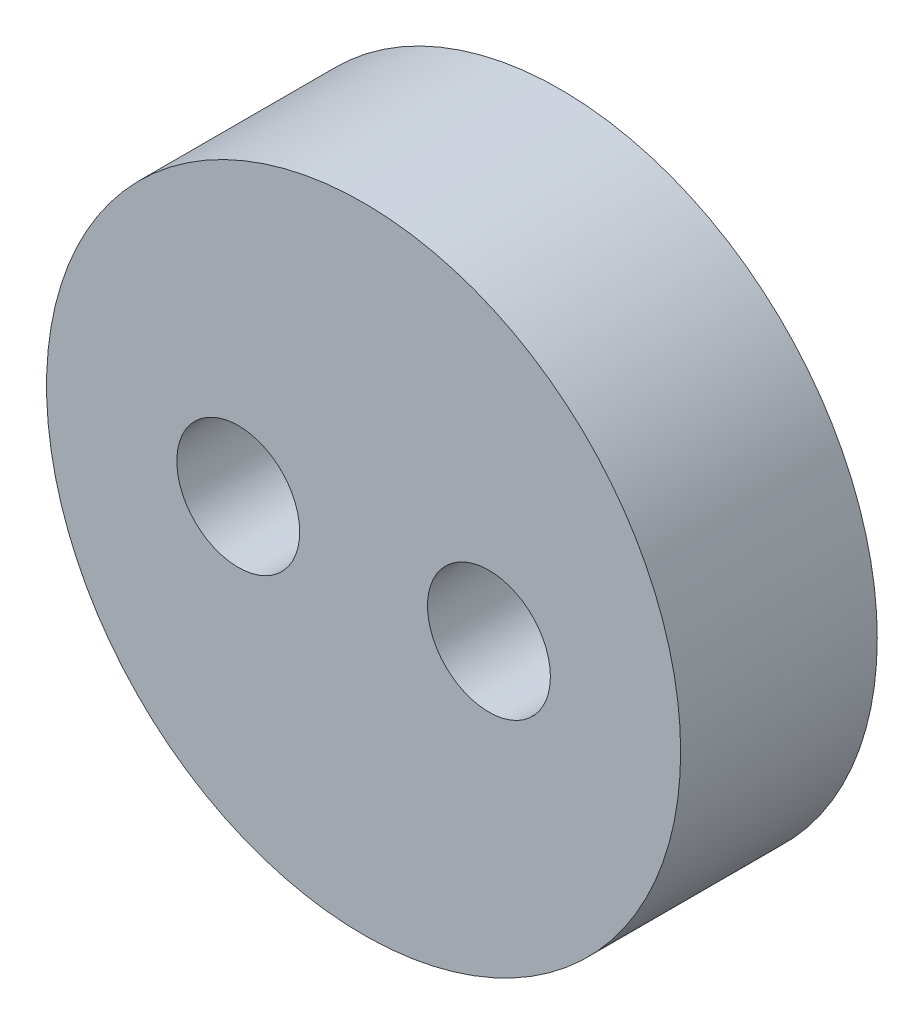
ISO-10303-21;
HEADER;
FILE_DESCRIPTION(('STEP AP214'),'2;1');
FILE_NAME('part.step','',(''),(''),'','','');
FILE_SCHEMA(('AUTOMOTIVE_DESIGN { 1 0 10303 214 1 1 1 1 }'));
ENDSEC;
DATA;
#1=APPLICATION_CONTEXT('core data for automotive mechanical design processes');
#2=APPLICATION_PROTOCOL_DEFINITION('international standard','automotive_design',2000,#1);
#3=PRODUCT_CONTEXT('',#1,'mechanical');
#4=PRODUCT('Part','Part','',(#3));
#5=PRODUCT_RELATED_PRODUCT_CATEGORY('part','',(#4));
#6=PRODUCT_DEFINITION_FORMATION('','',#4);
#7=PRODUCT_DEFINITION_CONTEXT('part definition',#1,'design');
#8=PRODUCT_DEFINITION('design','',#6,#7);
#9=PRODUCT_DEFINITION_SHAPE('','',#8);
#10=(LENGTH_UNIT() NAMED_UNIT(*) SI_UNIT(.MILLI.,.METRE.));
#11=(NAMED_UNIT(*) PLANE_ANGLE_UNIT() SI_UNIT($,.RADIAN.));
#12=(NAMED_UNIT(*) SI_UNIT($,.STERADIAN.) SOLID_ANGLE_UNIT());
#13=UNCERTAINTY_MEASURE_WITH_UNIT(LENGTH_MEASURE(1.E-05),#10,'distance_accuracy_value','');
#14=(GEOMETRIC_REPRESENTATION_CONTEXT(3) GLOBAL_UNCERTAINTY_ASSIGNED_CONTEXT((#13)) GLOBAL_UNIT_ASSIGNED_CONTEXT((#10,
#11,#12)) REPRESENTATION_CONTEXT('',''));
#15=CARTESIAN_POINT('',(0.,0.,0.));
#16=DIRECTION('',(0.,0.,1.));
#17=DIRECTION('',(1.,0.,0.));
#18=AXIS2_PLACEMENT_3D('',#15,#16,#17);
#19=CARTESIAN_POINT('',(-3.09418181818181,0.,0.));
#20=DIRECTION('',(0.,0.,1.));
#21=DIRECTION('',(1.,0.,0.));
#22=AXIS2_PLACEMENT_3D('',#19,#20,#21);
#23=PLANE('',#22);
#24=CARTESIAN_POINT('',(-3.23849999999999,0.,0.));
#25=DIRECTION('',(0.,0.,1.));
#26=DIRECTION('',(1.,0.,0.));
#27=AXIS2_PLACEMENT_3D('',#24,#25,#26);
#28=CIRCLE('',#27,1.5875);
#29=CARTESIAN_POINT('',(-1.65099999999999,0.,0.));
#30=VERTEX_POINT('',#29);
#31=EDGE_CURVE('E18',#30,#30,#28,.T.);
#32=ORIENTED_EDGE('',*,*,#31,.T.);
#33=EDGE_LOOP('',(#32));
#34=FACE_BOUND('',#33,.T.);
#35=ADVANCED_FACE('F14',(#34),#23,.T.);
#36=CARTESIAN_POINT('',(3.3828181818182,0.,0.));
#37=DIRECTION('',(0.,0.,1.));
#38=DIRECTION('',(1.,0.,0.));
#39=AXIS2_PLACEMENT_3D('',#36,#37,#38);
#40=PLANE('',#39);
#41=CARTESIAN_POINT('',(3.2385,0.,0.));
#42=DIRECTION('',(0.,0.,1.));
#43=DIRECTION('',(1.,0.,0.));
#44=AXIS2_PLACEMENT_3D('',#41,#42,#43);
#45=CIRCLE('',#44,1.5875);
#46=CARTESIAN_POINT('',(4.826,0.,0.));
#47=VERTEX_POINT('',#46);
#48=EDGE_CURVE('E34',#47,#47,#45,.T.);
#49=ORIENTED_EDGE('',*,*,#48,.T.);
#50=EDGE_LOOP('',(#49));
#51=FACE_BOUND('',#50,.T.);
#52=ADVANCED_FACE('F45',(#51),#40,.T.);
#53=CARTESIAN_POINT('',(-3.23849999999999,0.,0.));
#54=DIRECTION('',(0.,0.,1.));
#55=DIRECTION('',(1.,0.,0.));
#56=AXIS2_PLACEMENT_3D('',#53,#54,#55);
#57=CYLINDRICAL_SURFACE('',#56,1.5875);
#58=CARTESIAN_POINT('',(-3.23849999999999,0.,2.53999999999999));
#59=DIRECTION('',(0.,0.,1.));
#60=DIRECTION('',(1.,0.,0.));
#61=AXIS2_PLACEMENT_3D('',#58,#59,#60);
#62=CIRCLE('',#61,1.5875);
#63=CARTESIAN_POINT('',(-1.65099999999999,0.,2.53999999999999));
#64=VERTEX_POINT('',#63);
#65=EDGE_CURVE('E32',#64,#64,#62,.F.);
#66=ORIENTED_EDGE('',*,*,#65,.F.);
#67=EDGE_LOOP('',(#66));
#68=FACE_BOUND('',#67,.T.);
#69=ORIENTED_EDGE('',*,*,#31,.F.);
#70=EDGE_LOOP('',(#69));
#71=FACE_BOUND('',#70,.T.);
#72=ADVANCED_FACE('F42',(#68,#71),#57,.F.);
#73=CARTESIAN_POINT('',(3.2385,0.,0.));
#74=DIRECTION('',(0.,0.,1.));
#75=DIRECTION('',(1.,0.,0.));
#76=AXIS2_PLACEMENT_3D('',#73,#74,#75);
#77=CYLINDRICAL_SURFACE('',#76,1.5875);
#78=CARTESIAN_POINT('',(3.2385,0.,2.53999999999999));
#79=DIRECTION('',(0.,0.,1.));
#80=DIRECTION('',(1.,0.,0.));
#81=AXIS2_PLACEMENT_3D('',#78,#79,#80);
#82=CIRCLE('',#81,1.5875);
#83=CARTESIAN_POINT('',(4.826,0.,2.53999999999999));
#84=VERTEX_POINT('',#83);
#85=EDGE_CURVE('E27',#84,#84,#82,.F.);
#86=ORIENTED_EDGE('',*,*,#85,.F.);
#87=EDGE_LOOP('',(#86));
#88=FACE_BOUND('',#87,.T.);
#89=ORIENTED_EDGE('',*,*,#48,.F.);
#90=EDGE_LOOP('',(#89));
#91=FACE_BOUND('',#90,.T.);
#92=ADVANCED_FACE('F44',(#88,#91),#77,.F.);
#93=CARTESIAN_POINT('',(0.744681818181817,0.,-2.54));
#94=DIRECTION('',(0.,0.,1.));
#95=DIRECTION('',(1.,0.,0.));
#96=AXIS2_PLACEMENT_3D('',#93,#94,#95);
#97=PLANE('',#96);
#98=CARTESIAN_POINT('',(0.,0.,-2.54));
#99=DIRECTION('',(0.,0.,1.));
#100=DIRECTION('',(1.,0.,0.));
#101=AXIS2_PLACEMENT_3D('',#98,#99,#100);
#102=CIRCLE('',#101,8.1915);
#103=CARTESIAN_POINT('',(8.1915,0.,-2.54));
#104=VERTEX_POINT('',#103);
#105=EDGE_CURVE('E22',#104,#104,#102,.T.);
#106=ORIENTED_EDGE('',*,*,#105,.F.);
#107=EDGE_LOOP('',(#106));
#108=FACE_BOUND('',#107,.T.);
#109=ADVANCED_FACE('F53',(#108),#97,.F.);
#110=CARTESIAN_POINT('',(0.744681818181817,0.,2.53999999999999));
#111=DIRECTION('',(0.,0.,1.));
#112=DIRECTION('',(1.,0.,0.));
#113=AXIS2_PLACEMENT_3D('',#110,#111,#112);
#114=PLANE('',#113);
#115=ORIENTED_EDGE('',*,*,#85,.T.);
#116=EDGE_LOOP('',(#115));
#117=FACE_BOUND('',#116,.T.);
#118=ORIENTED_EDGE('',*,*,#65,.T.);
#119=EDGE_LOOP('',(#118));
#120=FACE_BOUND('',#119,.T.);
#121=CARTESIAN_POINT('',(0.,0.,2.53999999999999));
#122=DIRECTION('',(0.,0.,1.));
#123=DIRECTION('',(1.,0.,0.));
#124=AXIS2_PLACEMENT_3D('',#121,#122,#123);
#125=CIRCLE('',#124,8.1915);
#126=CARTESIAN_POINT('',(8.1915,0.,2.53999999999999));
#127=VERTEX_POINT('',#126);
#128=EDGE_CURVE('E10',#127,#127,#125,.F.);
#129=ORIENTED_EDGE('',*,*,#128,.F.);
#130=EDGE_LOOP('',(#129));
#131=FACE_BOUND('',#130,.T.);
#132=ADVANCED_FACE('F59',(#117,#120,#131),#114,.T.);
#133=CARTESIAN_POINT('',(0.,0.,-2.54));
#134=DIRECTION('',(0.,0.,1.));
#135=DIRECTION('',(1.,0.,0.));
#136=AXIS2_PLACEMENT_3D('',#133,#134,#135);
#137=CYLINDRICAL_SURFACE('',#136,8.1915);
#138=ORIENTED_EDGE('',*,*,#105,.T.);
#139=EDGE_LOOP('',(#138));
#140=FACE_BOUND('',#139,.T.);
#141=ORIENTED_EDGE('',*,*,#128,.T.);
#142=EDGE_LOOP('',(#141));
#143=FACE_BOUND('',#142,.T.);
#144=ADVANCED_FACE('F16',(#140,#143),#137,.T.);
#145=CLOSED_SHELL('',(#35,#52,#72,#92,#109,#132,#144));
#146=MANIFOLD_SOLID_BREP('B1',#145);
#147=ADVANCED_BREP_SHAPE_REPRESENTATION('',(#18,#146),#14);
#148=SHAPE_DEFINITION_REPRESENTATION(#9,#147);
ENDSEC;
END-ISO-10303-21;
